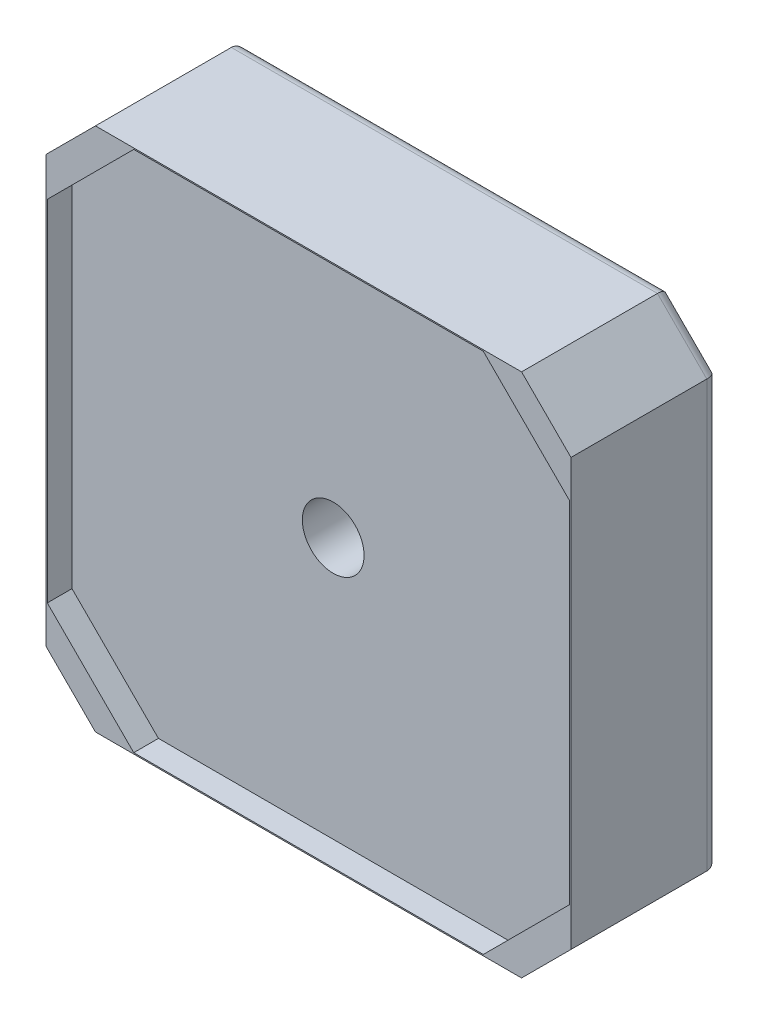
ISO-10303-21;
HEADER;
FILE_DESCRIPTION(('STEP AP214'),'2;1');
FILE_NAME('part.step','',(''),(''),'','','');
FILE_SCHEMA(('AUTOMOTIVE_DESIGN { 1 0 10303 214 1 1 1 1 }'));
ENDSEC;
DATA;
#1=APPLICATION_CONTEXT('core data for automotive mechanical design processes');
#2=APPLICATION_PROTOCOL_DEFINITION('international standard','automotive_design',2000,#1);
#3=PRODUCT_CONTEXT('',#1,'mechanical');
#4=PRODUCT('Part','Part','',(#3));
#5=PRODUCT_RELATED_PRODUCT_CATEGORY('part','',(#4));
#6=PRODUCT_DEFINITION_FORMATION('','',#4);
#7=PRODUCT_DEFINITION_CONTEXT('part definition',#1,'design');
#8=PRODUCT_DEFINITION('design','',#6,#7);
#9=PRODUCT_DEFINITION_SHAPE('','',#8);
#10=(LENGTH_UNIT() NAMED_UNIT(*) SI_UNIT(.MILLI.,.METRE.));
#11=(NAMED_UNIT(*) PLANE_ANGLE_UNIT() SI_UNIT($,.RADIAN.));
#12=(NAMED_UNIT(*) SI_UNIT($,.STERADIAN.) SOLID_ANGLE_UNIT());
#13=UNCERTAINTY_MEASURE_WITH_UNIT(LENGTH_MEASURE(1.E-05),#10,'distance_accuracy_value','');
#14=(GEOMETRIC_REPRESENTATION_CONTEXT(3) GLOBAL_UNCERTAINTY_ASSIGNED_CONTEXT((#13)) GLOBAL_UNIT_ASSIGNED_CONTEXT((#10,
#11,#12)) REPRESENTATION_CONTEXT('',''));
#15=CARTESIAN_POINT('',(0.,0.,0.));
#16=DIRECTION('',(0.,0.,1.));
#17=DIRECTION('',(1.,0.,0.));
#18=AXIS2_PLACEMENT_3D('',#15,#16,#17);
#19=CARTESIAN_POINT('',(-21.25,-17.25,12.));
#20=DIRECTION('',(1.,0.,0.));
#21=DIRECTION('',(0.,0.,-1.));
#22=AXIS2_PLACEMENT_3D('',#19,#20,#21);
#23=PLANE('',#22);
#24=DIRECTION('',(0.,0.,-1.));
#25=VECTOR('',#24,1.);
#26=CARTESIAN_POINT('',(-21.25,17.25,12.));
#27=LINE('',#26,#25);
#28=CARTESIAN_POINT('',(-21.25,17.25,12.));
#29=VERTEX_POINT('',#28);
#30=CARTESIAN_POINT('',(-21.25,17.25,1.));
#31=VERTEX_POINT('',#30);
#32=EDGE_CURVE('E267',#29,#31,#27,.T.);
#33=ORIENTED_EDGE('',*,*,#32,.T.);
#34=DIRECTION('',(0.,-1.,0.));
#35=VECTOR('',#34,1.);
#36=CARTESIAN_POINT('',(-21.25,-17.25,1.));
#37=LINE('',#36,#35);
#38=CARTESIAN_POINT('',(-21.25,-17.25,1.));
#39=VERTEX_POINT('',#38);
#40=EDGE_CURVE('E312',#31,#39,#37,.T.);
#41=ORIENTED_EDGE('',*,*,#40,.T.);
#42=DIRECTION('',(0.,0.,-1.));
#43=VECTOR('',#42,1.);
#44=CARTESIAN_POINT('',(-21.25,-17.25,12.));
#45=LINE('',#44,#43);
#46=CARTESIAN_POINT('',(-21.25,-17.25,12.));
#47=VERTEX_POINT('',#46);
#48=EDGE_CURVE('E285',#47,#39,#45,.T.);
#49=ORIENTED_EDGE('',*,*,#48,.F.);
#50=DIRECTION('',(0.,-1.,0.));
#51=VECTOR('',#50,1.);
#52=CARTESIAN_POINT('',(-21.25,-17.25,12.));
#53=LINE('',#52,#51);
#54=EDGE_CURVE('E239',#29,#47,#53,.T.);
#55=ORIENTED_EDGE('',*,*,#54,.F.);
#56=EDGE_LOOP('',(#33,#41,#49,#55));
#57=FACE_BOUND('',#56,.T.);
#58=ADVANCED_FACE('F33',(#57),#23,.F.);
#59=CARTESIAN_POINT('',(-21.25,-17.25,12.));
#60=DIRECTION('',(0.707106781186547,0.707106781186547,0.));
#61=DIRECTION('',(-0.707106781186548,0.707106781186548,0.));
#62=AXIS2_PLACEMENT_3D('',#59,#60,#61);
#63=PLANE('',#62);
#64=ORIENTED_EDGE('',*,*,#48,.T.);
#65=DIRECTION('',(0.707106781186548,-0.707106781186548,0.));
#66=VECTOR('',#65,1.);
#67=CARTESIAN_POINT('',(-17.25,-21.25,1.));
#68=LINE('',#67,#66);
#69=CARTESIAN_POINT('',(-17.25,-21.25,1.));
#70=VERTEX_POINT('',#69);
#71=EDGE_CURVE('E310',#39,#70,#68,.T.);
#72=ORIENTED_EDGE('',*,*,#71,.T.);
#73=DIRECTION('',(0.,0.,-1.));
#74=VECTOR('',#73,1.);
#75=CARTESIAN_POINT('',(-17.25,-21.25,12.));
#76=LINE('',#75,#74);
#77=CARTESIAN_POINT('',(-17.25,-21.25,12.));
#78=VERTEX_POINT('',#77);
#79=EDGE_CURVE('E282',#78,#70,#76,.T.);
#80=ORIENTED_EDGE('',*,*,#79,.F.);
#81=DIRECTION('',(0.707106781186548,-0.707106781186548,0.));
#82=VECTOR('',#81,1.);
#83=CARTESIAN_POINT('',(-21.25,-17.25,12.));
#84=LINE('',#83,#82);
#85=EDGE_CURVE('E253',#47,#78,#84,.T.);
#86=ORIENTED_EDGE('',*,*,#85,.F.);
#87=EDGE_LOOP('',(#64,#72,#80,#86));
#88=FACE_BOUND('',#87,.T.);
#89=ADVANCED_FACE('F399',(#88),#63,.F.);
#90=CARTESIAN_POINT('',(-17.25,-21.25,12.));
#91=DIRECTION('',(0.,1.,0.));
#92=DIRECTION('',(0.,0.,1.));
#93=AXIS2_PLACEMENT_3D('',#90,#91,#92);
#94=PLANE('',#93);
#95=ORIENTED_EDGE('',*,*,#79,.T.);
#96=DIRECTION('',(1.,0.,0.));
#97=VECTOR('',#96,1.);
#98=CARTESIAN_POINT('',(17.25,-21.25,1.));
#99=LINE('',#98,#97);
#100=CARTESIAN_POINT('',(17.25,-21.25,1.));
#101=VERTEX_POINT('',#100);
#102=EDGE_CURVE('E308',#70,#101,#99,.T.);
#103=ORIENTED_EDGE('',*,*,#102,.T.);
#104=DIRECTION('',(0.,0.,-1.));
#105=VECTOR('',#104,1.);
#106=CARTESIAN_POINT('',(17.25,-21.25,12.));
#107=LINE('',#106,#105);
#108=CARTESIAN_POINT('',(17.25,-21.25,12.));
#109=VERTEX_POINT('',#108);
#110=EDGE_CURVE('E279',#109,#101,#107,.T.);
#111=ORIENTED_EDGE('',*,*,#110,.F.);
#112=DIRECTION('',(1.,0.,0.));
#113=VECTOR('',#112,1.);
#114=CARTESIAN_POINT('',(-17.25,-21.25,12.));
#115=LINE('',#114,#113);
#116=EDGE_CURVE('E255',#78,#109,#115,.T.);
#117=ORIENTED_EDGE('',*,*,#116,.F.);
#118=EDGE_LOOP('',(#95,#103,#111,#117));
#119=FACE_BOUND('',#118,.T.);
#120=ADVANCED_FACE('F405',(#119),#94,.F.);
#121=CARTESIAN_POINT('',(17.25,-21.25,12.));
#122=DIRECTION('',(-0.707106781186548,0.707106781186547,0.));
#123=DIRECTION('',(-0.707106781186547,-0.707106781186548,0.));
#124=AXIS2_PLACEMENT_3D('',#121,#122,#123);
#125=PLANE('',#124);
#126=ORIENTED_EDGE('',*,*,#110,.T.);
#127=DIRECTION('',(0.707106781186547,0.707106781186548,0.));
#128=VECTOR('',#127,1.);
#129=CARTESIAN_POINT('',(21.25,-17.25,1.));
#130=LINE('',#129,#128);
#131=CARTESIAN_POINT('',(21.25,-17.25,1.));
#132=VERTEX_POINT('',#131);
#133=EDGE_CURVE('E288',#101,#132,#130,.T.);
#134=ORIENTED_EDGE('',*,*,#133,.T.);
#135=DIRECTION('',(0.,0.,-1.));
#136=VECTOR('',#135,1.);
#137=CARTESIAN_POINT('',(21.25,-17.25,12.));
#138=LINE('',#137,#136);
#139=CARTESIAN_POINT('',(21.25,-17.25,12.));
#140=VERTEX_POINT('',#139);
#141=EDGE_CURVE('E277',#140,#132,#138,.T.);
#142=ORIENTED_EDGE('',*,*,#141,.F.);
#143=DIRECTION('',(0.707106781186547,0.707106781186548,0.));
#144=VECTOR('',#143,1.);
#145=CARTESIAN_POINT('',(17.25,-21.25,12.));
#146=LINE('',#145,#144);
#147=EDGE_CURVE('E257',#109,#140,#146,.T.);
#148=ORIENTED_EDGE('',*,*,#147,.F.);
#149=EDGE_LOOP('',(#126,#134,#142,#148));
#150=FACE_BOUND('',#149,.T.);
#151=ADVANCED_FACE('F526',(#150),#125,.F.);
#152=CARTESIAN_POINT('',(21.25,-17.25,12.));
#153=DIRECTION('',(-1.,0.,0.));
#154=DIRECTION('',(0.,-1.,0.));
#155=AXIS2_PLACEMENT_3D('',#152,#153,#154);
#156=PLANE('',#155);
#157=ORIENTED_EDGE('',*,*,#141,.T.);
#158=DIRECTION('',(0.,1.,0.));
#159=VECTOR('',#158,1.);
#160=CARTESIAN_POINT('',(21.25,17.25,1.));
#161=LINE('',#160,#159);
#162=CARTESIAN_POINT('',(21.25,17.25,1.));
#163=VERTEX_POINT('',#162);
#164=EDGE_CURVE('E56',#132,#163,#161,.T.);
#165=ORIENTED_EDGE('',*,*,#164,.T.);
#166=DIRECTION('',(0.,0.,-1.));
#167=VECTOR('',#166,1.);
#168=CARTESIAN_POINT('',(21.25,17.25,12.));
#169=LINE('',#168,#167);
#170=CARTESIAN_POINT('',(21.25,17.25,12.));
#171=VERTEX_POINT('',#170);
#172=EDGE_CURVE('E275',#171,#163,#169,.T.);
#173=ORIENTED_EDGE('',*,*,#172,.F.);
#174=DIRECTION('',(0.,1.,0.));
#175=VECTOR('',#174,1.);
#176=CARTESIAN_POINT('',(21.25,-17.25,12.));
#177=LINE('',#176,#175);
#178=EDGE_CURVE('E259',#140,#171,#177,.T.);
#179=ORIENTED_EDGE('',*,*,#178,.F.);
#180=EDGE_LOOP('',(#157,#165,#173,#179));
#181=FACE_BOUND('',#180,.T.);
#182=ADVANCED_FACE('F523',(#181),#156,.F.);
#183=CARTESIAN_POINT('',(17.25,21.25,12.));
#184=DIRECTION('',(-0.707106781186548,-0.707106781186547,0.));
#185=DIRECTION('',(0.707106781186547,-0.707106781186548,0.));
#186=AXIS2_PLACEMENT_3D('',#183,#184,#185);
#187=PLANE('',#186);
#188=ORIENTED_EDGE('',*,*,#172,.T.);
#189=DIRECTION('',(-0.707106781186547,0.707106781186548,0.));
#190=VECTOR('',#189,1.);
#191=CARTESIAN_POINT('',(17.25,21.25,1.));
#192=LINE('',#191,#190);
#193=CARTESIAN_POINT('',(17.25,21.25,1.));
#194=VERTEX_POINT('',#193);
#195=EDGE_CURVE('E48',#163,#194,#192,.T.);
#196=ORIENTED_EDGE('',*,*,#195,.T.);
#197=DIRECTION('',(0.,0.,-1.));
#198=VECTOR('',#197,1.);
#199=CARTESIAN_POINT('',(17.25,21.25,12.));
#200=LINE('',#199,#198);
#201=CARTESIAN_POINT('',(17.25,21.25,12.));
#202=VERTEX_POINT('',#201);
#203=EDGE_CURVE('E273',#202,#194,#200,.T.);
#204=ORIENTED_EDGE('',*,*,#203,.F.);
#205=DIRECTION('',(-0.707106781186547,0.707106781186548,0.));
#206=VECTOR('',#205,1.);
#207=CARTESIAN_POINT('',(17.25,21.25,12.));
#208=LINE('',#207,#206);
#209=EDGE_CURVE('E261',#171,#202,#208,.T.);
#210=ORIENTED_EDGE('',*,*,#209,.F.);
#211=EDGE_LOOP('',(#188,#196,#204,#210));
#212=FACE_BOUND('',#211,.T.);
#213=ADVANCED_FACE('F519',(#212),#187,.F.);
#214=CARTESIAN_POINT('',(-17.25,21.25,12.));
#215=DIRECTION('',(0.,-1.,0.));
#216=DIRECTION('',(0.,0.,-1.));
#217=AXIS2_PLACEMENT_3D('',#214,#215,#216);
#218=PLANE('',#217);
#219=ORIENTED_EDGE('',*,*,#203,.T.);
#220=DIRECTION('',(-1.,0.,0.));
#221=VECTOR('',#220,1.);
#222=CARTESIAN_POINT('',(-17.25,21.25,1.));
#223=LINE('',#222,#221);
#224=CARTESIAN_POINT('',(-17.25,21.25,1.));
#225=VERTEX_POINT('',#224);
#226=EDGE_CURVE('E318',#194,#225,#223,.T.);
#227=ORIENTED_EDGE('',*,*,#226,.T.);
#228=DIRECTION('',(0.,0.,-1.));
#229=VECTOR('',#228,1.);
#230=CARTESIAN_POINT('',(-17.25,21.25,12.));
#231=LINE('',#230,#229);
#232=CARTESIAN_POINT('',(-17.25,21.25,12.));
#233=VERTEX_POINT('',#232);
#234=EDGE_CURVE('E270',#233,#225,#231,.T.);
#235=ORIENTED_EDGE('',*,*,#234,.F.);
#236=DIRECTION('',(-1.,0.,0.));
#237=VECTOR('',#236,1.);
#238=CARTESIAN_POINT('',(-17.25,21.25,12.));
#239=LINE('',#238,#237);
#240=EDGE_CURVE('E263',#202,#233,#239,.T.);
#241=ORIENTED_EDGE('',*,*,#240,.F.);
#242=EDGE_LOOP('',(#219,#227,#235,#241));
#243=FACE_BOUND('',#242,.T.);
#244=ADVANCED_FACE('F515',(#243),#218,.F.);
#245=CARTESIAN_POINT('',(-21.25,17.25,12.));
#246=DIRECTION('',(0.707106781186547,-0.707106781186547,0.));
#247=DIRECTION('',(0.707106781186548,0.707106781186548,0.));
#248=AXIS2_PLACEMENT_3D('',#245,#246,#247);
#249=PLANE('',#248);
#250=ORIENTED_EDGE('',*,*,#234,.T.);
#251=DIRECTION('',(-0.707106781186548,-0.707106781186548,0.));
#252=VECTOR('',#251,1.);
#253=CARTESIAN_POINT('',(-21.25,17.25,1.));
#254=LINE('',#253,#252);
#255=EDGE_CURVE('E314',#225,#31,#254,.T.);
#256=ORIENTED_EDGE('',*,*,#255,.T.);
#257=ORIENTED_EDGE('',*,*,#32,.F.);
#258=DIRECTION('',(-0.707106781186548,-0.707106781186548,0.));
#259=VECTOR('',#258,1.);
#260=CARTESIAN_POINT('',(-21.25,17.25,12.));
#261=LINE('',#260,#259);
#262=EDGE_CURVE('E265',#233,#29,#261,.T.);
#263=ORIENTED_EDGE('',*,*,#262,.F.);
#264=EDGE_LOOP('',(#250,#256,#257,#263));
#265=FACE_BOUND('',#264,.T.);
#266=ADVANCED_FACE('F508',(#265),#249,.F.);
#267=CARTESIAN_POINT('',(0.,0.,12.));
#268=DIRECTION('',(0.,0.,-1.));
#269=DIRECTION('',(-1.,0.,0.));
#270=AXIS2_PLACEMENT_3D('',#267,#268,#269);
#271=PLANE('',#270);
#272=DIRECTION('',(0.707106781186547,-0.707106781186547,0.));
#273=VECTOR('',#272,1.);
#274=CARTESIAN_POINT('',(-21.15,-14.15,12.));
#275=LINE('',#274,#273);
#276=CARTESIAN_POINT('',(-21.15,-14.15,12.));
#277=VERTEX_POINT('',#276);
#278=CARTESIAN_POINT('',(-14.15,-21.15,12.));
#279=VERTEX_POINT('',#278);
#280=EDGE_CURVE('E221',#277,#279,#275,.T.);
#281=ORIENTED_EDGE('',*,*,#280,.F.);
#282=DIRECTION('',(0.,-1.,0.));
#283=VECTOR('',#282,1.);
#284=CARTESIAN_POINT('',(-21.15,-14.15,12.));
#285=LINE('',#284,#283);
#286=CARTESIAN_POINT('',(-21.15,14.15,12.));
#287=VERTEX_POINT('',#286);
#288=EDGE_CURVE('E180',#287,#277,#285,.T.);
#289=ORIENTED_EDGE('',*,*,#288,.F.);
#290=DIRECTION('',(-0.707106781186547,-0.707106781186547,0.));
#291=VECTOR('',#290,1.);
#292=CARTESIAN_POINT('',(-21.15,14.15,12.));
#293=LINE('',#292,#291);
#294=CARTESIAN_POINT('',(-14.15,21.15,12.));
#295=VERTEX_POINT('',#294);
#296=EDGE_CURVE('E198',#295,#287,#293,.T.);
#297=ORIENTED_EDGE('',*,*,#296,.F.);
#298=DIRECTION('',(-1.,0.,0.));
#299=VECTOR('',#298,1.);
#300=CARTESIAN_POINT('',(-14.15,21.15,12.));
#301=LINE('',#300,#299);
#302=CARTESIAN_POINT('',(14.15,21.15,12.));
#303=VERTEX_POINT('',#302);
#304=EDGE_CURVE('E201',#303,#295,#301,.T.);
#305=ORIENTED_EDGE('',*,*,#304,.F.);
#306=DIRECTION('',(-0.707106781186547,0.707106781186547,0.));
#307=VECTOR('',#306,1.);
#308=CARTESIAN_POINT('',(14.15,21.15,12.));
#309=LINE('',#308,#307);
#310=CARTESIAN_POINT('',(21.15,14.15,12.));
#311=VERTEX_POINT('',#310);
#312=EDGE_CURVE('E232',#311,#303,#309,.T.);
#313=ORIENTED_EDGE('',*,*,#312,.F.);
#314=DIRECTION('',(0.,1.,0.));
#315=VECTOR('',#314,1.);
#316=CARTESIAN_POINT('',(21.15,-14.15,12.));
#317=LINE('',#316,#315);
#318=CARTESIAN_POINT('',(21.15,-14.15,12.));
#319=VERTEX_POINT('',#318);
#320=EDGE_CURVE('E229',#319,#311,#317,.T.);
#321=ORIENTED_EDGE('',*,*,#320,.F.);
#322=DIRECTION('',(0.707106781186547,0.707106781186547,0.));
#323=VECTOR('',#322,1.);
#324=CARTESIAN_POINT('',(14.15,-21.15,12.));
#325=LINE('',#324,#323);
#326=CARTESIAN_POINT('',(14.15,-21.15,12.));
#327=VERTEX_POINT('',#326);
#328=EDGE_CURVE('E226',#327,#319,#325,.T.);
#329=ORIENTED_EDGE('',*,*,#328,.F.);
#330=DIRECTION('',(1.,0.,0.));
#331=VECTOR('',#330,1.);
#332=CARTESIAN_POINT('',(-14.15,-21.15,12.));
#333=LINE('',#332,#331);
#334=EDGE_CURVE('E223',#279,#327,#333,.T.);
#335=ORIENTED_EDGE('',*,*,#334,.F.);
#336=EDGE_LOOP('',(#281,#289,#297,#305,#313,#321,#329,#335));
#337=FACE_BOUND('',#336,.T.);
#338=ORIENTED_EDGE('',*,*,#54,.T.);
#339=ORIENTED_EDGE('',*,*,#85,.T.);
#340=ORIENTED_EDGE('',*,*,#116,.T.);
#341=ORIENTED_EDGE('',*,*,#147,.T.);
#342=ORIENTED_EDGE('',*,*,#178,.T.);
#343=ORIENTED_EDGE('',*,*,#209,.T.);
#344=ORIENTED_EDGE('',*,*,#240,.T.);
#345=ORIENTED_EDGE('',*,*,#262,.T.);
#346=EDGE_LOOP('',(#338,#339,#340,#341,#342,#343,#344,#345));
#347=FACE_BOUND('',#346,.T.);
#348=ADVANCED_FACE('F499',(#337,#347),#271,.F.);
#349=CARTESIAN_POINT('',(0.,0.,0.));
#350=DIRECTION('',(0.,0.,-1.));
#351=DIRECTION('',(-1.,0.,0.));
#352=AXIS2_PLACEMENT_3D('',#349,#350,#351);
#353=PLANE('',#352);
#354=CARTESIAN_POINT('',(15.5,-15.5,0.));
#355=DIRECTION('',(0.,0.,-1.));
#356=DIRECTION('',(-1.,0.,0.));
#357=AXIS2_PLACEMENT_3D('',#354,#355,#356);
#358=CIRCLE('',#357,1.5);
#359=CARTESIAN_POINT('',(14.,-15.5,0.));
#360=VERTEX_POINT('',#359);
#361=EDGE_CURVE('E374',#360,#360,#358,.F.);
#362=ORIENTED_EDGE('',*,*,#361,.T.);
#363=EDGE_LOOP('',(#362));
#364=FACE_BOUND('',#363,.T.);
#365=CARTESIAN_POINT('',(-15.5,-15.5,0.));
#366=DIRECTION('',(0.,0.,-1.));
#367=DIRECTION('',(-1.,0.,0.));
#368=AXIS2_PLACEMENT_3D('',#365,#366,#367);
#369=CIRCLE('',#368,1.5);
#370=CARTESIAN_POINT('',(-17.,-15.5,0.));
#371=VERTEX_POINT('',#370);
#372=EDGE_CURVE('E371',#371,#371,#369,.F.);
#373=ORIENTED_EDGE('',*,*,#372,.T.);
#374=EDGE_LOOP('',(#373));
#375=FACE_BOUND('',#374,.T.);
#376=CARTESIAN_POINT('',(-15.5,15.5,0.));
#377=DIRECTION('',(0.,0.,-1.));
#378=DIRECTION('',(-1.,0.,0.));
#379=AXIS2_PLACEMENT_3D('',#376,#377,#378);
#380=CIRCLE('',#379,1.5);
#381=CARTESIAN_POINT('',(-17.,15.5,0.));
#382=VERTEX_POINT('',#381);
#383=EDGE_CURVE('E368',#382,#382,#380,.F.);
#384=ORIENTED_EDGE('',*,*,#383,.T.);
#385=EDGE_LOOP('',(#384));
#386=FACE_BOUND('',#385,.T.);
#387=CARTESIAN_POINT('',(15.5,15.5,0.));
#388=DIRECTION('',(0.,0.,-1.));
#389=DIRECTION('',(-1.,0.,0.));
#390=AXIS2_PLACEMENT_3D('',#387,#388,#389);
#391=CIRCLE('',#390,1.5);
#392=CARTESIAN_POINT('',(14.,15.5,0.));
#393=VERTEX_POINT('',#392);
#394=EDGE_CURVE('E365',#393,#393,#391,.F.);
#395=ORIENTED_EDGE('',*,*,#394,.T.);
#396=EDGE_LOOP('',(#395));
#397=FACE_BOUND('',#396,.T.);
#398=DIRECTION('',(0.,1.,0.));
#399=VECTOR('',#398,1.);
#400=CARTESIAN_POINT('',(20.25,-17.25,0.));
#401=LINE('',#400,#399);
#402=CARTESIAN_POINT('',(20.25,16.8357864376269,0.));
#403=VERTEX_POINT('',#402);
#404=CARTESIAN_POINT('',(20.25,-16.8357864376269,0.));
#405=VERTEX_POINT('',#404);
#406=EDGE_CURVE('E295',#403,#405,#401,.F.);
#407=ORIENTED_EDGE('',*,*,#406,.T.);
#408=DIRECTION('',(0.707106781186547,0.707106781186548,0.));
#409=VECTOR('',#408,1.);
#410=CARTESIAN_POINT('',(16.5428932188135,-20.5428932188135,0.));
#411=LINE('',#410,#409);
#412=CARTESIAN_POINT('',(16.8357864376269,-20.25,0.));
#413=VERTEX_POINT('',#412);
#414=EDGE_CURVE('E305',#405,#413,#411,.F.);
#415=ORIENTED_EDGE('',*,*,#414,.T.);
#416=DIRECTION('',(1.,0.,0.));
#417=VECTOR('',#416,1.);
#418=CARTESIAN_POINT('',(-17.25,-20.25,0.));
#419=LINE('',#418,#417);
#420=CARTESIAN_POINT('',(-16.8357864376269,-20.25,0.));
#421=VERTEX_POINT('',#420);
#422=EDGE_CURVE('E303',#413,#421,#419,.F.);
#423=ORIENTED_EDGE('',*,*,#422,.T.);
#424=DIRECTION('',(0.707106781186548,-0.707106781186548,0.));
#425=VECTOR('',#424,1.);
#426=CARTESIAN_POINT('',(-20.5428932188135,-16.5428932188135,0.));
#427=LINE('',#426,#425);
#428=CARTESIAN_POINT('',(-20.25,-16.8357864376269,0.));
#429=VERTEX_POINT('',#428);
#430=EDGE_CURVE('E301',#421,#429,#427,.F.);
#431=ORIENTED_EDGE('',*,*,#430,.T.);
#432=DIRECTION('',(0.,-1.,0.));
#433=VECTOR('',#432,1.);
#434=CARTESIAN_POINT('',(-20.25,17.25,0.));
#435=LINE('',#434,#433);
#436=CARTESIAN_POINT('',(-20.25,16.8357864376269,0.));
#437=VERTEX_POINT('',#436);
#438=EDGE_CURVE('E299',#429,#437,#435,.F.);
#439=ORIENTED_EDGE('',*,*,#438,.T.);
#440=DIRECTION('',(-0.707106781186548,-0.707106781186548,0.));
#441=VECTOR('',#440,1.);
#442=CARTESIAN_POINT('',(-16.5428932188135,20.5428932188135,0.));
#443=LINE('',#442,#441);
#444=CARTESIAN_POINT('',(-16.8357864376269,20.25,0.));
#445=VERTEX_POINT('',#444);
#446=EDGE_CURVE('E297',#437,#445,#443,.F.);
#447=ORIENTED_EDGE('',*,*,#446,.T.);
#448=DIRECTION('',(-1.,0.,0.));
#449=VECTOR('',#448,1.);
#450=CARTESIAN_POINT('',(17.25,20.25,0.));
#451=LINE('',#450,#449);
#452=CARTESIAN_POINT('',(16.8357864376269,20.25,0.));
#453=VERTEX_POINT('',#452);
#454=EDGE_CURVE('E291',#445,#453,#451,.F.);
#455=ORIENTED_EDGE('',*,*,#454,.T.);
#456=DIRECTION('',(-0.707106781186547,0.707106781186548,0.));
#457=VECTOR('',#456,1.);
#458=CARTESIAN_POINT('',(20.5428932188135,16.5428932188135,0.));
#459=LINE('',#458,#457);
#460=EDGE_CURVE('E293',#453,#403,#459,.F.);
#461=ORIENTED_EDGE('',*,*,#460,.T.);
#462=EDGE_LOOP('',(#407,#415,#423,#431,#439,#447,#455,#461));
#463=FACE_BOUND('',#462,.T.);
#464=CARTESIAN_POINT('',(0.,0.,0.));
#465=DIRECTION('',(0.,0.,-1.));
#466=DIRECTION('',(-1.,0.,0.));
#467=AXIS2_PLACEMENT_3D('',#464,#465,#466);
#468=CIRCLE('',#467,11.);
#469=CARTESIAN_POINT('',(-11.,0.,0.));
#470=VERTEX_POINT('',#469);
#471=EDGE_CURVE('E204',#470,#470,#468,.T.);
#472=ORIENTED_EDGE('',*,*,#471,.F.);
#473=EDGE_LOOP('',(#472));
#474=FACE_BOUND('',#473,.T.);
#475=ADVANCED_FACE('F497',(#364,#375,#386,#397,#463,#474),#353,.T.);
#476=CARTESIAN_POINT('',(-21.15,-14.15,10.));
#477=DIRECTION('',(-1.,0.,0.));
#478=DIRECTION('',(0.,0.,1.));
#479=AXIS2_PLACEMENT_3D('',#476,#477,#478);
#480=PLANE('',#479);
#481=ORIENTED_EDGE('',*,*,#288,.T.);
#482=DIRECTION('',(0.,0.,1.));
#483=VECTOR('',#482,1.);
#484=CARTESIAN_POINT('',(-21.15,-14.15,10.));
#485=LINE('',#484,#483);
#486=CARTESIAN_POINT('',(-21.15,-14.15,10.));
#487=VERTEX_POINT('',#486);
#488=EDGE_CURVE('E173',#487,#277,#485,.T.);
#489=ORIENTED_EDGE('',*,*,#488,.F.);
#490=DIRECTION('',(0.,-1.,0.));
#491=VECTOR('',#490,1.);
#492=CARTESIAN_POINT('',(-21.15,-14.15,10.));
#493=LINE('',#492,#491);
#494=CARTESIAN_POINT('',(-21.15,14.15,10.));
#495=VERTEX_POINT('',#494);
#496=EDGE_CURVE('E177',#495,#487,#493,.T.);
#497=ORIENTED_EDGE('',*,*,#496,.F.);
#498=DIRECTION('',(0.,0.,1.));
#499=VECTOR('',#498,1.);
#500=CARTESIAN_POINT('',(-21.15,14.15,10.));
#501=LINE('',#500,#499);
#502=EDGE_CURVE('E237',#495,#287,#501,.T.);
#503=ORIENTED_EDGE('',*,*,#502,.T.);
#504=EDGE_LOOP('',(#481,#489,#497,#503));
#505=FACE_BOUND('',#504,.T.);
#506=ADVANCED_FACE('F175',(#505),#480,.F.);
#507=CARTESIAN_POINT('',(-21.15,14.15,10.));
#508=DIRECTION('',(-0.707106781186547,0.707106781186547,0.));
#509=DIRECTION('',(-0.707106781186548,-0.707106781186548,0.));
#510=AXIS2_PLACEMENT_3D('',#507,#508,#509);
#511=PLANE('',#510);
#512=ORIENTED_EDGE('',*,*,#296,.T.);
#513=ORIENTED_EDGE('',*,*,#502,.F.);
#514=DIRECTION('',(-0.707106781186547,-0.707106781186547,0.));
#515=VECTOR('',#514,1.);
#516=CARTESIAN_POINT('',(-21.15,14.15,10.));
#517=LINE('',#516,#515);
#518=CARTESIAN_POINT('',(-14.15,21.15,10.));
#519=VERTEX_POINT('',#518);
#520=EDGE_CURVE('E185',#519,#495,#517,.T.);
#521=ORIENTED_EDGE('',*,*,#520,.F.);
#522=DIRECTION('',(0.,0.,1.));
#523=VECTOR('',#522,1.);
#524=CARTESIAN_POINT('',(-14.15,21.15,10.));
#525=LINE('',#524,#523);
#526=EDGE_CURVE('E240',#519,#295,#525,.T.);
#527=ORIENTED_EDGE('',*,*,#526,.T.);
#528=EDGE_LOOP('',(#512,#513,#521,#527));
#529=FACE_BOUND('',#528,.T.);
#530=ADVANCED_FACE('F506',(#529),#511,.F.);
#531=CARTESIAN_POINT('',(-14.15,21.15,10.));
#532=DIRECTION('',(0.,1.,0.));
#533=DIRECTION('',(0.,0.,1.));
#534=AXIS2_PLACEMENT_3D('',#531,#532,#533);
#535=PLANE('',#534);
#536=ORIENTED_EDGE('',*,*,#304,.T.);
#537=ORIENTED_EDGE('',*,*,#526,.F.);
#538=DIRECTION('',(-1.,0.,0.));
#539=VECTOR('',#538,1.);
#540=CARTESIAN_POINT('',(-14.15,21.15,10.));
#541=LINE('',#540,#539);
#542=CARTESIAN_POINT('',(14.15,21.15,10.));
#543=VERTEX_POINT('',#542);
#544=EDGE_CURVE('E217',#543,#519,#541,.T.);
#545=ORIENTED_EDGE('',*,*,#544,.F.);
#546=DIRECTION('',(0.,0.,1.));
#547=VECTOR('',#546,1.);
#548=CARTESIAN_POINT('',(14.15,21.15,10.));
#549=LINE('',#548,#547);
#550=EDGE_CURVE('E242',#543,#303,#549,.T.);
#551=ORIENTED_EDGE('',*,*,#550,.T.);
#552=EDGE_LOOP('',(#536,#537,#545,#551));
#553=FACE_BOUND('',#552,.T.);
#554=ADVANCED_FACE('F613',(#553),#535,.F.);
#555=CARTESIAN_POINT('',(14.15,21.15,10.));
#556=DIRECTION('',(0.707106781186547,0.707106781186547,0.));
#557=DIRECTION('',(-0.707106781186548,0.707106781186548,0.));
#558=AXIS2_PLACEMENT_3D('',#555,#556,#557);
#559=PLANE('',#558);
#560=ORIENTED_EDGE('',*,*,#312,.T.);
#561=ORIENTED_EDGE('',*,*,#550,.F.);
#562=DIRECTION('',(-0.707106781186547,0.707106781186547,0.));
#563=VECTOR('',#562,1.);
#564=CARTESIAN_POINT('',(14.15,21.15,10.));
#565=LINE('',#564,#563);
#566=CARTESIAN_POINT('',(21.15,14.15,10.));
#567=VERTEX_POINT('',#566);
#568=EDGE_CURVE('E214',#567,#543,#565,.T.);
#569=ORIENTED_EDGE('',*,*,#568,.F.);
#570=DIRECTION('',(0.,0.,1.));
#571=VECTOR('',#570,1.);
#572=CARTESIAN_POINT('',(21.15,14.15,10.));
#573=LINE('',#572,#571);
#574=EDGE_CURVE('E244',#567,#311,#573,.T.);
#575=ORIENTED_EDGE('',*,*,#574,.T.);
#576=EDGE_LOOP('',(#560,#561,#569,#575));
#577=FACE_BOUND('',#576,.T.);
#578=ADVANCED_FACE('F623',(#577),#559,.F.);
#579=CARTESIAN_POINT('',(21.15,-14.15,10.));
#580=DIRECTION('',(1.,0.,0.));
#581=DIRECTION('',(0.,0.,-1.));
#582=AXIS2_PLACEMENT_3D('',#579,#580,#581);
#583=PLANE('',#582);
#584=ORIENTED_EDGE('',*,*,#320,.T.);
#585=ORIENTED_EDGE('',*,*,#574,.F.);
#586=DIRECTION('',(0.,1.,0.));
#587=VECTOR('',#586,1.);
#588=CARTESIAN_POINT('',(21.15,-14.15,10.));
#589=LINE('',#588,#587);
#590=CARTESIAN_POINT('',(21.15,-14.15,10.));
#591=VERTEX_POINT('',#590);
#592=EDGE_CURVE('E211',#591,#567,#589,.T.);
#593=ORIENTED_EDGE('',*,*,#592,.F.);
#594=DIRECTION('',(0.,0.,1.));
#595=VECTOR('',#594,1.);
#596=CARTESIAN_POINT('',(21.15,-14.15,10.));
#597=LINE('',#596,#595);
#598=EDGE_CURVE('E246',#591,#319,#597,.T.);
#599=ORIENTED_EDGE('',*,*,#598,.T.);
#600=EDGE_LOOP('',(#584,#585,#593,#599));
#601=FACE_BOUND('',#600,.T.);
#602=ADVANCED_FACE('F633',(#601),#583,.F.);
#603=CARTESIAN_POINT('',(14.15,-21.15,10.));
#604=DIRECTION('',(0.707106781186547,-0.707106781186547,0.));
#605=DIRECTION('',(0.707106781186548,0.707106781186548,0.));
#606=AXIS2_PLACEMENT_3D('',#603,#604,#605);
#607=PLANE('',#606);
#608=ORIENTED_EDGE('',*,*,#328,.T.);
#609=ORIENTED_EDGE('',*,*,#598,.F.);
#610=DIRECTION('',(0.707106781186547,0.707106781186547,0.));
#611=VECTOR('',#610,1.);
#612=CARTESIAN_POINT('',(14.15,-21.15,10.));
#613=LINE('',#612,#611);
#614=CARTESIAN_POINT('',(14.15,-21.15,10.));
#615=VERTEX_POINT('',#614);
#616=EDGE_CURVE('E208',#615,#591,#613,.T.);
#617=ORIENTED_EDGE('',*,*,#616,.F.);
#618=DIRECTION('',(0.,0.,1.));
#619=VECTOR('',#618,1.);
#620=CARTESIAN_POINT('',(14.15,-21.15,10.));
#621=LINE('',#620,#619);
#622=EDGE_CURVE('E248',#615,#327,#621,.T.);
#623=ORIENTED_EDGE('',*,*,#622,.T.);
#624=EDGE_LOOP('',(#608,#609,#617,#623));
#625=FACE_BOUND('',#624,.T.);
#626=ADVANCED_FACE('F643',(#625),#607,.F.);
#627=CARTESIAN_POINT('',(-14.15,-21.15,10.));
#628=DIRECTION('',(0.,-1.,0.));
#629=DIRECTION('',(0.,0.,-1.));
#630=AXIS2_PLACEMENT_3D('',#627,#628,#629);
#631=PLANE('',#630);
#632=ORIENTED_EDGE('',*,*,#334,.T.);
#633=ORIENTED_EDGE('',*,*,#622,.F.);
#634=DIRECTION('',(1.,0.,0.));
#635=VECTOR('',#634,1.);
#636=CARTESIAN_POINT('',(-14.15,-21.15,10.));
#637=LINE('',#636,#635);
#638=CARTESIAN_POINT('',(-14.15,-21.15,10.));
#639=VERTEX_POINT('',#638);
#640=EDGE_CURVE('E193',#639,#615,#637,.T.);
#641=ORIENTED_EDGE('',*,*,#640,.F.);
#642=DIRECTION('',(0.,0.,1.));
#643=VECTOR('',#642,1.);
#644=CARTESIAN_POINT('',(-14.15,-21.15,10.));
#645=LINE('',#644,#643);
#646=EDGE_CURVE('E184',#639,#279,#645,.T.);
#647=ORIENTED_EDGE('',*,*,#646,.T.);
#648=EDGE_LOOP('',(#632,#633,#641,#647));
#649=FACE_BOUND('',#648,.T.);
#650=ADVANCED_FACE('F653',(#649),#631,.F.);
#651=CARTESIAN_POINT('',(-21.15,-14.15,10.));
#652=DIRECTION('',(-0.707106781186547,-0.707106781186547,0.));
#653=DIRECTION('',(0.707106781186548,-0.707106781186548,0.));
#654=AXIS2_PLACEMENT_3D('',#651,#652,#653);
#655=PLANE('',#654);
#656=ORIENTED_EDGE('',*,*,#280,.T.);
#657=ORIENTED_EDGE('',*,*,#646,.F.);
#658=DIRECTION('',(0.707106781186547,-0.707106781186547,0.));
#659=VECTOR('',#658,1.);
#660=CARTESIAN_POINT('',(-21.15,-14.15,10.));
#661=LINE('',#660,#659);
#662=EDGE_CURVE('E188',#487,#639,#661,.T.);
#663=ORIENTED_EDGE('',*,*,#662,.F.);
#664=ORIENTED_EDGE('',*,*,#488,.T.);
#665=EDGE_LOOP('',(#656,#657,#663,#664));
#666=FACE_BOUND('',#665,.T.);
#667=ADVANCED_FACE('F189',(#666),#655,.F.);
#668=CARTESIAN_POINT('',(0.,0.,10.));
#669=DIRECTION('',(0.,0.,-1.));
#670=DIRECTION('',(-1.,0.,0.));
#671=AXIS2_PLACEMENT_3D('',#668,#669,#670);
#672=PLANE('',#671);
#673=CARTESIAN_POINT('',(0.,0.,10.));
#674=DIRECTION('',(0.,0.,-1.));
#675=DIRECTION('',(-1.,0.,0.));
#676=AXIS2_PLACEMENT_3D('',#673,#674,#675);
#677=CIRCLE('',#676,2.5);
#678=CARTESIAN_POINT('',(-2.5,0.,10.));
#679=VERTEX_POINT('',#678);
#680=EDGE_CURVE('E488',#679,#679,#677,.T.);
#681=ORIENTED_EDGE('',*,*,#680,.T.);
#682=EDGE_LOOP('',(#681));
#683=FACE_BOUND('',#682,.T.);
#684=ORIENTED_EDGE('',*,*,#496,.T.);
#685=ORIENTED_EDGE('',*,*,#662,.T.);
#686=ORIENTED_EDGE('',*,*,#640,.T.);
#687=ORIENTED_EDGE('',*,*,#616,.T.);
#688=ORIENTED_EDGE('',*,*,#592,.T.);
#689=ORIENTED_EDGE('',*,*,#568,.T.);
#690=ORIENTED_EDGE('',*,*,#544,.T.);
#691=ORIENTED_EDGE('',*,*,#520,.T.);
#692=EDGE_LOOP('',(#684,#685,#686,#687,#688,#689,#690,#691));
#693=FACE_BOUND('',#692,.T.);
#694=ADVANCED_FACE('F195',(#683,#693),#672,.F.);
#695=CARTESIAN_POINT('',(0.,0.,-2.));
#696=DIRECTION('',(0.,0.,1.));
#697=DIRECTION('',(1.,0.,0.));
#698=AXIS2_PLACEMENT_3D('',#695,#696,#697);
#699=CYLINDRICAL_SURFACE('',#698,11.);
#700=CARTESIAN_POINT('',(0.,0.,-1.5));
#701=DIRECTION('',(0.,0.,-1.));
#702=DIRECTION('',(-1.,0.,0.));
#703=AXIS2_PLACEMENT_3D('',#700,#701,#702);
#704=CIRCLE('',#703,11.);
#705=CARTESIAN_POINT('',(-11.,0.,-1.5));
#706=VERTEX_POINT('',#705);
#707=EDGE_CURVE('E359',#706,#706,#704,.F.);
#708=ORIENTED_EDGE('',*,*,#707,.T.);
#709=EDGE_LOOP('',(#708));
#710=FACE_BOUND('',#709,.T.);
#711=ORIENTED_EDGE('',*,*,#471,.T.);
#712=EDGE_LOOP('',(#711));
#713=FACE_BOUND('',#712,.T.);
#714=ADVANCED_FACE('F495',(#710,#713),#699,.T.);
#715=CARTESIAN_POINT('',(0.,0.,-2.));
#716=DIRECTION('',(0.,0.,-1.));
#717=DIRECTION('',(-1.,0.,0.));
#718=AXIS2_PLACEMENT_3D('',#715,#716,#717);
#719=PLANE('',#718);
#720=CARTESIAN_POINT('',(0.,0.,-2.));
#721=DIRECTION('',(0.,0.,-1.));
#722=DIRECTION('',(-1.,0.,0.));
#723=AXIS2_PLACEMENT_3D('',#720,#721,#722);
#724=CIRCLE('',#723,6.);
#725=CARTESIAN_POINT('',(-6.,0.,-2.));
#726=VERTEX_POINT('',#725);
#727=EDGE_CURVE('E353',#726,#726,#724,.F.);
#728=ORIENTED_EDGE('',*,*,#727,.T.);
#729=EDGE_LOOP('',(#728));
#730=FACE_BOUND('',#729,.T.);
#731=CARTESIAN_POINT('',(0.,0.,-2.));
#732=DIRECTION('',(0.,0.,-1.));
#733=DIRECTION('',(-1.,0.,0.));
#734=AXIS2_PLACEMENT_3D('',#731,#732,#733);
#735=CIRCLE('',#734,10.5);
#736=CARTESIAN_POINT('',(-10.5,0.,-2.));
#737=VERTEX_POINT('',#736);
#738=EDGE_CURVE('E350',#737,#737,#735,.T.);
#739=ORIENTED_EDGE('',*,*,#738,.T.);
#740=EDGE_LOOP('',(#739));
#741=FACE_BOUND('',#740,.T.);
#742=ADVANCED_FACE('F880',(#730,#741),#719,.T.);
#743=CARTESIAN_POINT('',(0.,0.,5.));
#744=DIRECTION('',(0.,0.,-1.));
#745=DIRECTION('',(-1.,0.,0.));
#746=AXIS2_PLACEMENT_3D('',#743,#744,#745);
#747=CYLINDRICAL_SURFACE('',#746,5.5);
#748=CARTESIAN_POINT('',(0.,0.,-1.5));
#749=DIRECTION('',(0.,0.,-1.));
#750=DIRECTION('',(-1.,0.,0.));
#751=AXIS2_PLACEMENT_3D('',#748,#749,#750);
#752=CIRCLE('',#751,5.5);
#753=CARTESIAN_POINT('',(-5.5,0.,-1.5));
#754=VERTEX_POINT('',#753);
#755=EDGE_CURVE('E347',#754,#754,#752,.T.);
#756=ORIENTED_EDGE('',*,*,#755,.T.);
#757=EDGE_LOOP('',(#756));
#758=FACE_BOUND('',#757,.T.);
#759=CARTESIAN_POINT('',(0.,0.,4.5));
#760=DIRECTION('',(0.,0.,-1.));
#761=DIRECTION('',(-1.,0.,0.));
#762=AXIS2_PLACEMENT_3D('',#759,#760,#761);
#763=CIRCLE('',#762,5.5);
#764=CARTESIAN_POINT('',(-5.5,0.,4.5));
#765=VERTEX_POINT('',#764);
#766=EDGE_CURVE('E320',#765,#765,#763,.F.);
#767=ORIENTED_EDGE('',*,*,#766,.T.);
#768=EDGE_LOOP('',(#767));
#769=FACE_BOUND('',#768,.T.);
#770=ADVANCED_FACE('F877',(#758,#769),#747,.F.);
#771=CARTESIAN_POINT('',(0.,0.,5.));
#772=DIRECTION('',(0.,0.,-1.));
#773=DIRECTION('',(-1.,0.,0.));
#774=AXIS2_PLACEMENT_3D('',#771,#772,#773);
#775=PLANE('',#774);
#776=CARTESIAN_POINT('',(0.,0.,5.));
#777=DIRECTION('',(0.,0.,-1.));
#778=DIRECTION('',(-1.,0.,0.));
#779=AXIS2_PLACEMENT_3D('',#776,#777,#778);
#780=CIRCLE('',#779,5.);
#781=CARTESIAN_POINT('',(-5.,0.,5.));
#782=VERTEX_POINT('',#781);
#783=EDGE_CURVE('E356',#782,#782,#780,.T.);
#784=ORIENTED_EDGE('',*,*,#783,.T.);
#785=EDGE_LOOP('',(#784));
#786=FACE_BOUND('',#785,.T.);
#787=CARTESIAN_POINT('',(0.,0.,5.));
#788=DIRECTION('',(0.,0.,-1.));
#789=DIRECTION('',(-1.,0.,0.));
#790=AXIS2_PLACEMENT_3D('',#787,#788,#789);
#791=CIRCLE('',#790,2.5);
#792=CARTESIAN_POINT('',(-2.5,0.,5.));
#793=VERTEX_POINT('',#792);
#794=EDGE_CURVE('E344',#793,#793,#791,.T.);
#795=ORIENTED_EDGE('',*,*,#794,.F.);
#796=EDGE_LOOP('',(#795));
#797=FACE_BOUND('',#796,.T.);
#798=ADVANCED_FACE('F689',(#786,#797),#775,.T.);
#799=CARTESIAN_POINT('',(0.,0.,12.));
#800=DIRECTION('',(0.,0.,-1.));
#801=DIRECTION('',(-1.,0.,0.));
#802=AXIS2_PLACEMENT_3D('',#799,#800,#801);
#803=CYLINDRICAL_SURFACE('',#802,2.5);
#804=ORIENTED_EDGE('',*,*,#794,.T.);
#805=EDGE_LOOP('',(#804));
#806=FACE_BOUND('',#805,.T.);
#807=ORIENTED_EDGE('',*,*,#680,.F.);
#808=EDGE_LOOP('',(#807));
#809=FACE_BOUND('',#808,.T.);
#810=ADVANCED_FACE('F442',(#806,#809),#803,.F.);
#811=CARTESIAN_POINT('',(-20.5428932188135,16.5428932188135,1.));
#812=DIRECTION('',(0.707106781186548,0.707106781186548,0.));
#813=DIRECTION('',(-0.707106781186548,0.707106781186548,0.));
#814=AXIS2_PLACEMENT_3D('',#811,#812,#813);
#815=CYLINDRICAL_SURFACE('',#814,1.);
#816=CARTESIAN_POINT('',(-16.8357864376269,20.25,1.));
#817=DIRECTION('',(0.923879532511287,0.38268343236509,0.));
#818=DIRECTION('',(0.38268343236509,-0.923879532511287,0.));
#819=AXIS2_PLACEMENT_3D('',#816,#817,#818);
#820=ELLIPSE('',#819,1.08239220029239,1.);
#821=EDGE_CURVE('E338',#445,#225,#820,.T.);
#822=ORIENTED_EDGE('',*,*,#821,.F.);
#823=ORIENTED_EDGE('',*,*,#446,.F.);
#824=CARTESIAN_POINT('',(-20.25,16.8357864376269,1.));
#825=DIRECTION('',(0.38268343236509,0.923879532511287,0.));
#826=DIRECTION('',(0.923879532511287,-0.38268343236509,0.));
#827=AXIS2_PLACEMENT_3D('',#824,#825,#826);
#828=ELLIPSE('',#827,1.08239220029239,1.);
#829=EDGE_CURVE('E341',#31,#437,#828,.F.);
#830=ORIENTED_EDGE('',*,*,#829,.F.);
#831=ORIENTED_EDGE('',*,*,#255,.F.);
#832=EDGE_LOOP('',(#822,#823,#830,#831));
#833=FACE_BOUND('',#832,.T.);
#834=ADVANCED_FACE('F438',(#833),#815,.T.);
#835=CARTESIAN_POINT('',(-20.25,-17.25,1.));
#836=DIRECTION('',(0.,1.,0.));
#837=DIRECTION('',(0.,0.,1.));
#838=AXIS2_PLACEMENT_3D('',#835,#836,#837);
#839=CYLINDRICAL_SURFACE('',#838,1.);
#840=ORIENTED_EDGE('',*,*,#829,.T.);
#841=ORIENTED_EDGE('',*,*,#438,.F.);
#842=CARTESIAN_POINT('',(-20.25,-16.8357864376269,1.));
#843=DIRECTION('',(-0.38268343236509,0.923879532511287,0.));
#844=DIRECTION('',(0.923879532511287,0.38268343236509,0.));
#845=AXIS2_PLACEMENT_3D('',#842,#843,#844);
#846=ELLIPSE('',#845,1.08239220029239,1.);
#847=EDGE_CURVE('E335',#39,#429,#846,.F.);
#848=ORIENTED_EDGE('',*,*,#847,.F.);
#849=ORIENTED_EDGE('',*,*,#40,.F.);
#850=EDGE_LOOP('',(#840,#841,#848,#849));
#851=FACE_BOUND('',#850,.T.);
#852=ADVANCED_FACE('F434',(#851),#839,.T.);
#853=CARTESIAN_POINT('',(-17.25,20.25,1.));
#854=DIRECTION('',(1.,0.,0.));
#855=DIRECTION('',(0.,0.,-1.));
#856=AXIS2_PLACEMENT_3D('',#853,#854,#855);
#857=CYLINDRICAL_SURFACE('',#856,1.);
#858=ORIENTED_EDGE('',*,*,#821,.T.);
#859=ORIENTED_EDGE('',*,*,#226,.F.);
#860=CARTESIAN_POINT('',(16.8357864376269,20.25,1.));
#861=DIRECTION('',(0.923879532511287,-0.38268343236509,0.));
#862=DIRECTION('',(0.38268343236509,0.923879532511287,0.));
#863=AXIS2_PLACEMENT_3D('',#860,#861,#862);
#864=ELLIPSE('',#863,1.08239220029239,1.);
#865=EDGE_CURVE('E332',#453,#194,#864,.T.);
#866=ORIENTED_EDGE('',*,*,#865,.F.);
#867=ORIENTED_EDGE('',*,*,#454,.F.);
#868=EDGE_LOOP('',(#858,#859,#866,#867));
#869=FACE_BOUND('',#868,.T.);
#870=ADVANCED_FACE('F430',(#869),#857,.T.);
#871=CARTESIAN_POINT('',(-20.5428932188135,-16.5428932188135,1.));
#872=DIRECTION('',(-0.707106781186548,0.707106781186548,0.));
#873=DIRECTION('',(-0.707106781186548,-0.707106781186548,0.));
#874=AXIS2_PLACEMENT_3D('',#871,#872,#873);
#875=CYLINDRICAL_SURFACE('',#874,1.);
#876=ORIENTED_EDGE('',*,*,#847,.T.);
#877=ORIENTED_EDGE('',*,*,#430,.F.);
#878=CARTESIAN_POINT('',(-16.8357864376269,-20.25,1.));
#879=DIRECTION('',(-0.923879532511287,0.38268343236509,0.));
#880=DIRECTION('',(0.38268343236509,0.923879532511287,0.));
#881=AXIS2_PLACEMENT_3D('',#878,#879,#880);
#882=ELLIPSE('',#881,1.08239220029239,1.);
#883=EDGE_CURVE('E329',#70,#421,#882,.F.);
#884=ORIENTED_EDGE('',*,*,#883,.F.);
#885=ORIENTED_EDGE('',*,*,#71,.F.);
#886=EDGE_LOOP('',(#876,#877,#884,#885));
#887=FACE_BOUND('',#886,.T.);
#888=ADVANCED_FACE('F426',(#887),#875,.T.);
#889=CARTESIAN_POINT('',(16.5428932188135,20.5428932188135,1.));
#890=DIRECTION('',(0.707106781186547,-0.707106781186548,0.));
#891=DIRECTION('',(0.707106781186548,0.707106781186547,0.));
#892=AXIS2_PLACEMENT_3D('',#889,#890,#891);
#893=CYLINDRICAL_SURFACE('',#892,1.);
#894=ORIENTED_EDGE('',*,*,#865,.T.);
#895=ORIENTED_EDGE('',*,*,#195,.F.);
#896=CARTESIAN_POINT('',(20.25,16.8357864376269,1.));
#897=DIRECTION('',(0.38268343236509,-0.923879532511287,0.));
#898=DIRECTION('',(0.923879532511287,0.38268343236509,0.));
#899=AXIS2_PLACEMENT_3D('',#896,#897,#898);
#900=ELLIPSE('',#899,1.08239220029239,1.);
#901=EDGE_CURVE('E326',#403,#163,#900,.T.);
#902=ORIENTED_EDGE('',*,*,#901,.F.);
#903=ORIENTED_EDGE('',*,*,#460,.F.);
#904=EDGE_LOOP('',(#894,#895,#902,#903));
#905=FACE_BOUND('',#904,.T.);
#906=ADVANCED_FACE('F422',(#905),#893,.T.);
#907=CARTESIAN_POINT('',(-17.25,-20.25,1.));
#908=DIRECTION('',(-1.,0.,0.));
#909=DIRECTION('',(0.,0.,1.));
#910=AXIS2_PLACEMENT_3D('',#907,#908,#909);
#911=CYLINDRICAL_SURFACE('',#910,1.);
#912=ORIENTED_EDGE('',*,*,#883,.T.);
#913=ORIENTED_EDGE('',*,*,#422,.F.);
#914=CARTESIAN_POINT('',(16.8357864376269,-20.25,1.));
#915=DIRECTION('',(-0.923879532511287,-0.38268343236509,0.));
#916=DIRECTION('',(-0.38268343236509,0.923879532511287,0.));
#917=AXIS2_PLACEMENT_3D('',#914,#915,#916);
#918=ELLIPSE('',#917,1.08239220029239,1.);
#919=EDGE_CURVE('E323',#101,#413,#918,.F.);
#920=ORIENTED_EDGE('',*,*,#919,.F.);
#921=ORIENTED_EDGE('',*,*,#102,.F.);
#922=EDGE_LOOP('',(#912,#913,#920,#921));
#923=FACE_BOUND('',#922,.T.);
#924=ADVANCED_FACE('F418',(#923),#911,.T.);
#925=CARTESIAN_POINT('',(20.25,-17.25,1.));
#926=DIRECTION('',(0.,-1.,0.));
#927=DIRECTION('',(1.,0.,0.));
#928=AXIS2_PLACEMENT_3D('',#925,#926,#927);
#929=CYLINDRICAL_SURFACE('',#928,1.);
#930=ORIENTED_EDGE('',*,*,#901,.T.);
#931=ORIENTED_EDGE('',*,*,#164,.F.);
#932=CARTESIAN_POINT('',(20.25,-16.8357864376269,1.));
#933=DIRECTION('',(-0.382683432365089,-0.923879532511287,0.));
#934=DIRECTION('',(0.923879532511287,-0.38268343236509,0.));
#935=AXIS2_PLACEMENT_3D('',#932,#933,#934);
#936=ELLIPSE('',#935,1.08239220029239,1.);
#937=EDGE_CURVE('E321',#405,#132,#936,.T.);
#938=ORIENTED_EDGE('',*,*,#937,.F.);
#939=ORIENTED_EDGE('',*,*,#406,.F.);
#940=EDGE_LOOP('',(#930,#931,#938,#939));
#941=FACE_BOUND('',#940,.T.);
#942=ADVANCED_FACE('F414',(#941),#929,.T.);
#943=CARTESIAN_POINT('',(16.5428932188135,-20.5428932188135,1.));
#944=DIRECTION('',(-0.707106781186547,-0.707106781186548,0.));
#945=DIRECTION('',(0.707106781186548,-0.707106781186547,0.));
#946=AXIS2_PLACEMENT_3D('',#943,#944,#945);
#947=CYLINDRICAL_SURFACE('',#946,1.);
#948=ORIENTED_EDGE('',*,*,#919,.T.);
#949=ORIENTED_EDGE('',*,*,#414,.F.);
#950=ORIENTED_EDGE('',*,*,#937,.T.);
#951=ORIENTED_EDGE('',*,*,#133,.F.);
#952=EDGE_LOOP('',(#948,#949,#950,#951));
#953=FACE_BOUND('',#952,.T.);
#954=ADVANCED_FACE('F410',(#953),#947,.T.);
#955=CARTESIAN_POINT('',(0.,0.,-1.5));
#956=DIRECTION('',(0.,0.,-1.));
#957=DIRECTION('',(-1.,0.,0.));
#958=AXIS2_PLACEMENT_3D('',#955,#956,#957);
#959=TOROIDAL_SURFACE('',#958,6.,0.5);
#960=ORIENTED_EDGE('',*,*,#727,.F.);
#961=EDGE_LOOP('',(#960));
#962=FACE_BOUND('',#961,.T.);
#963=ORIENTED_EDGE('',*,*,#755,.F.);
#964=EDGE_LOOP('',(#963));
#965=FACE_BOUND('',#964,.T.);
#966=ADVANCED_FACE('F413',(#962,#965),#959,.T.);
#967=CARTESIAN_POINT('',(0.,0.,4.5));
#968=DIRECTION('',(0.,0.,-1.));
#969=DIRECTION('',(-1.,0.,0.));
#970=AXIS2_PLACEMENT_3D('',#967,#968,#969);
#971=TOROIDAL_SURFACE('',#970,5.,0.5);
#972=ORIENTED_EDGE('',*,*,#766,.F.);
#973=EDGE_LOOP('',(#972));
#974=FACE_BOUND('',#973,.T.);
#975=ORIENTED_EDGE('',*,*,#783,.F.);
#976=EDGE_LOOP('',(#975));
#977=FACE_BOUND('',#976,.T.);
#978=ADVANCED_FACE('F446',(#974,#977),#971,.F.);
#979=CARTESIAN_POINT('',(0.,0.,-1.5));
#980=DIRECTION('',(0.,0.,-1.));
#981=DIRECTION('',(-1.,0.,0.));
#982=AXIS2_PLACEMENT_3D('',#979,#980,#981);
#983=TOROIDAL_SURFACE('',#982,10.5,0.5);
#984=ORIENTED_EDGE('',*,*,#707,.F.);
#985=EDGE_LOOP('',(#984));
#986=FACE_BOUND('',#985,.T.);
#987=ORIENTED_EDGE('',*,*,#738,.F.);
#988=EDGE_LOOP('',(#987));
#989=FACE_BOUND('',#988,.T.);
#990=ADVANCED_FACE('F450',(#986,#989),#983,.T.);
#991=CARTESIAN_POINT('',(15.5,15.5,3.));
#992=DIRECTION('',(0.,0.,-1.));
#993=DIRECTION('',(-1.,0.,0.));
#994=AXIS2_PLACEMENT_3D('',#991,#992,#993);
#995=CYLINDRICAL_SURFACE('',#994,0.999999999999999);
#996=CARTESIAN_POINT('',(15.5,15.5,0.5));
#997=DIRECTION('',(0.,0.,-1.));
#998=DIRECTION('',(-1.,0.,0.));
#999=AXIS2_PLACEMENT_3D('',#996,#997,#998);
#1000=CIRCLE('',#999,0.999999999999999);
#1001=CARTESIAN_POINT('',(14.5,15.5,0.5));
#1002=VERTEX_POINT('',#1001);
#1003=EDGE_CURVE('E11',#1002,#1002,#1000,.T.);
#1004=ORIENTED_EDGE('',*,*,#1003,.T.);
#1005=EDGE_LOOP('',(#1004));
#1006=FACE_BOUND('',#1005,.T.);
#1007=CARTESIAN_POINT('',(15.5,15.5,3.));
#1008=DIRECTION('',(0.,0.,-1.));
#1009=DIRECTION('',(-1.,0.,0.));
#1010=AXIS2_PLACEMENT_3D('',#1007,#1008,#1009);
#1011=CIRCLE('',#1010,0.999999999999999);
#1012=CARTESIAN_POINT('',(14.5,15.5,3.));
#1013=VERTEX_POINT('',#1012);
#1014=EDGE_CURVE('E324',#1013,#1013,#1011,.T.);
#1015=ORIENTED_EDGE('',*,*,#1014,.F.);
#1016=EDGE_LOOP('',(#1015));
#1017=FACE_BOUND('',#1016,.T.);
#1018=ADVANCED_FACE('F454',(#1006,#1017),#995,.F.);
#1019=CARTESIAN_POINT('',(15.5,15.5,3.));
#1020=DIRECTION('',(0.,0.,-1.));
#1021=DIRECTION('',(-1.,0.,0.));
#1022=AXIS2_PLACEMENT_3D('',#1019,#1020,#1021);
#1023=PLANE('',#1022);
#1024=ORIENTED_EDGE('',*,*,#1014,.T.);
#1025=EDGE_LOOP('',(#1024));
#1026=FACE_BOUND('',#1025,.T.);
#1027=ADVANCED_FACE('F472',(#1026),#1023,.T.);
#1028=CARTESIAN_POINT('',(15.5,-15.5,3.));
#1029=DIRECTION('',(0.,0.,-1.));
#1030=DIRECTION('',(-1.,0.,0.));
#1031=AXIS2_PLACEMENT_3D('',#1028,#1029,#1030);
#1032=CYLINDRICAL_SURFACE('',#1031,0.999999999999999);
#1033=CARTESIAN_POINT('',(15.5,-15.5,0.5));
#1034=DIRECTION('',(0.,0.,-1.));
#1035=DIRECTION('',(-1.,0.,0.));
#1036=AXIS2_PLACEMENT_3D('',#1033,#1034,#1035);
#1037=CIRCLE('',#1036,0.999999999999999);
#1038=CARTESIAN_POINT('',(14.5,-15.5,0.5));
#1039=VERTEX_POINT('',#1038);
#1040=EDGE_CURVE('E362',#1039,#1039,#1037,.T.);
#1041=ORIENTED_EDGE('',*,*,#1040,.T.);
#1042=EDGE_LOOP('',(#1041));
#1043=FACE_BOUND('',#1042,.T.);
#1044=CARTESIAN_POINT('',(15.5,-15.5,3.));
#1045=DIRECTION('',(0.,0.,-1.));
#1046=DIRECTION('',(-1.,0.,0.));
#1047=AXIS2_PLACEMENT_3D('',#1044,#1045,#1046);
#1048=CIRCLE('',#1047,0.999999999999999);
#1049=CARTESIAN_POINT('',(14.5,-15.5,3.));
#1050=VERTEX_POINT('',#1049);
#1051=EDGE_CURVE('E476',#1050,#1050,#1048,.T.);
#1052=ORIENTED_EDGE('',*,*,#1051,.F.);
#1053=EDGE_LOOP('',(#1052));
#1054=FACE_BOUND('',#1053,.T.);
#1055=ADVANCED_FACE('F468',(#1043,#1054),#1032,.F.);
#1056=CARTESIAN_POINT('',(15.5,-15.5,3.));
#1057=DIRECTION('',(0.,0.,-1.));
#1058=DIRECTION('',(-1.,0.,0.));
#1059=AXIS2_PLACEMENT_3D('',#1056,#1057,#1058);
#1060=PLANE('',#1059);
#1061=ORIENTED_EDGE('',*,*,#1051,.T.);
#1062=EDGE_LOOP('',(#1061));
#1063=FACE_BOUND('',#1062,.T.);
#1064=ADVANCED_FACE('F471',(#1063),#1060,.T.);
#1065=CARTESIAN_POINT('',(-15.5,-15.5,3.));
#1066=DIRECTION('',(0.,0.,-1.));
#1067=DIRECTION('',(-1.,0.,0.));
#1068=AXIS2_PLACEMENT_3D('',#1065,#1066,#1067);
#1069=CYLINDRICAL_SURFACE('',#1068,0.999999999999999);
#1070=CARTESIAN_POINT('',(-15.5,-15.5,0.5));
#1071=DIRECTION('',(0.,0.,-1.));
#1072=DIRECTION('',(-1.,0.,0.));
#1073=AXIS2_PLACEMENT_3D('',#1070,#1071,#1072);
#1074=CIRCLE('',#1073,0.999999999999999);
#1075=CARTESIAN_POINT('',(-16.5,-15.5,0.5));
#1076=VERTEX_POINT('',#1075);
#1077=EDGE_CURVE('E377',#1076,#1076,#1074,.T.);
#1078=ORIENTED_EDGE('',*,*,#1077,.T.);
#1079=EDGE_LOOP('',(#1078));
#1080=FACE_BOUND('',#1079,.T.);
#1081=CARTESIAN_POINT('',(-15.5,-15.5,3.));
#1082=DIRECTION('',(0.,0.,-1.));
#1083=DIRECTION('',(-1.,0.,0.));
#1084=AXIS2_PLACEMENT_3D('',#1081,#1082,#1083);
#1085=CIRCLE('',#1084,0.999999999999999);
#1086=CARTESIAN_POINT('',(-16.5,-15.5,3.));
#1087=VERTEX_POINT('',#1086);
#1088=EDGE_CURVE('E478',#1087,#1087,#1085,.T.);
#1089=ORIENTED_EDGE('',*,*,#1088,.F.);
#1090=EDGE_LOOP('',(#1089));
#1091=FACE_BOUND('',#1090,.T.);
#1092=ADVANCED_FACE('F787',(#1080,#1091),#1069,.F.);
#1093=CARTESIAN_POINT('',(-15.5,-15.5,3.));
#1094=DIRECTION('',(0.,0.,-1.));
#1095=DIRECTION('',(-1.,0.,0.));
#1096=AXIS2_PLACEMENT_3D('',#1093,#1094,#1095);
#1097=PLANE('',#1096);
#1098=ORIENTED_EDGE('',*,*,#1088,.T.);
#1099=EDGE_LOOP('',(#1098));
#1100=FACE_BOUND('',#1099,.T.);
#1101=ADVANCED_FACE('F794',(#1100),#1097,.T.);
#1102=CARTESIAN_POINT('',(-15.5,15.5,3.));
#1103=DIRECTION('',(0.,0.,-1.));
#1104=DIRECTION('',(-1.,0.,0.));
#1105=AXIS2_PLACEMENT_3D('',#1102,#1103,#1104);
#1106=CYLINDRICAL_SURFACE('',#1105,0.999999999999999);
#1107=CARTESIAN_POINT('',(-15.5,15.5,0.5));
#1108=DIRECTION('',(0.,0.,-1.));
#1109=DIRECTION('',(-1.,0.,0.));
#1110=AXIS2_PLACEMENT_3D('',#1107,#1108,#1109);
#1111=CIRCLE('',#1110,0.999999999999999);
#1112=CARTESIAN_POINT('',(-16.5,15.5,0.5));
#1113=VERTEX_POINT('',#1112);
#1114=EDGE_CURVE('E41',#1113,#1113,#1111,.T.);
#1115=ORIENTED_EDGE('',*,*,#1114,.T.);
#1116=EDGE_LOOP('',(#1115));
#1117=FACE_BOUND('',#1116,.T.);
#1118=CARTESIAN_POINT('',(-15.5,15.5,3.));
#1119=DIRECTION('',(0.,0.,-1.));
#1120=DIRECTION('',(-1.,0.,0.));
#1121=AXIS2_PLACEMENT_3D('',#1118,#1119,#1120);
#1122=CIRCLE('',#1121,0.999999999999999);
#1123=CARTESIAN_POINT('',(-16.5,15.5,3.));
#1124=VERTEX_POINT('',#1123);
#1125=EDGE_CURVE('E481',#1124,#1124,#1122,.T.);
#1126=ORIENTED_EDGE('',*,*,#1125,.F.);
#1127=EDGE_LOOP('',(#1126));
#1128=FACE_BOUND('',#1127,.T.);
#1129=ADVANCED_FACE('F382',(#1117,#1128),#1106,.F.);
#1130=CARTESIAN_POINT('',(-15.5,15.5,3.));
#1131=DIRECTION('',(0.,0.,-1.));
#1132=DIRECTION('',(-1.,0.,0.));
#1133=AXIS2_PLACEMENT_3D('',#1130,#1131,#1132);
#1134=PLANE('',#1133);
#1135=ORIENTED_EDGE('',*,*,#1125,.T.);
#1136=EDGE_LOOP('',(#1135));
#1137=FACE_BOUND('',#1136,.T.);
#1138=ADVANCED_FACE('F457',(#1137),#1134,.T.);
#1139=CARTESIAN_POINT('',(15.5,-15.5,0.5));
#1140=DIRECTION('',(0.,0.,-1.));
#1141=DIRECTION('',(-1.,0.,0.));
#1142=AXIS2_PLACEMENT_3D('',#1139,#1140,#1141);
#1143=TOROIDAL_SURFACE('',#1142,1.5,0.5);
#1144=ORIENTED_EDGE('',*,*,#361,.F.);
#1145=EDGE_LOOP('',(#1144));
#1146=FACE_BOUND('',#1145,.T.);
#1147=ORIENTED_EDGE('',*,*,#1040,.F.);
#1148=EDGE_LOOP('',(#1147));
#1149=FACE_BOUND('',#1148,.T.);
#1150=ADVANCED_FACE('F394',(#1146,#1149),#1143,.T.);
#1151=CARTESIAN_POINT('',(-15.5,-15.5,0.5));
#1152=DIRECTION('',(0.,0.,-1.));
#1153=DIRECTION('',(-1.,0.,0.));
#1154=AXIS2_PLACEMENT_3D('',#1151,#1152,#1153);
#1155=TOROIDAL_SURFACE('',#1154,1.5,0.5);
#1156=ORIENTED_EDGE('',*,*,#372,.F.);
#1157=EDGE_LOOP('',(#1156));
#1158=FACE_BOUND('',#1157,.T.);
#1159=ORIENTED_EDGE('',*,*,#1077,.F.);
#1160=EDGE_LOOP('',(#1159));
#1161=FACE_BOUND('',#1160,.T.);
#1162=ADVANCED_FACE('F387',(#1158,#1161),#1155,.T.);
#1163=CARTESIAN_POINT('',(-15.5,15.5,0.5));
#1164=DIRECTION('',(0.,0.,-1.));
#1165=DIRECTION('',(-1.,0.,0.));
#1166=AXIS2_PLACEMENT_3D('',#1163,#1164,#1165);
#1167=TOROIDAL_SURFACE('',#1166,1.5,0.5);
#1168=ORIENTED_EDGE('',*,*,#383,.F.);
#1169=EDGE_LOOP('',(#1168));
#1170=FACE_BOUND('',#1169,.T.);
#1171=ORIENTED_EDGE('',*,*,#1114,.F.);
#1172=EDGE_LOOP('',(#1171));
#1173=FACE_BOUND('',#1172,.T.);
#1174=ADVANCED_FACE('F385',(#1170,#1173),#1167,.T.);
#1175=CARTESIAN_POINT('',(15.5,15.5,0.5));
#1176=DIRECTION('',(0.,0.,-1.));
#1177=DIRECTION('',(-1.,0.,0.));
#1178=AXIS2_PLACEMENT_3D('',#1175,#1176,#1177);
#1179=TOROIDAL_SURFACE('',#1178,1.5,0.5);
#1180=ORIENTED_EDGE('',*,*,#394,.F.);
#1181=EDGE_LOOP('',(#1180));
#1182=FACE_BOUND('',#1181,.T.);
#1183=ORIENTED_EDGE('',*,*,#1003,.F.);
#1184=EDGE_LOOP('',(#1183));
#1185=FACE_BOUND('',#1184,.T.);
#1186=ADVANCED_FACE('F35',(#1182,#1185),#1179,.T.);
#1187=CLOSED_SHELL('',(#58,#89,#120,#151,#182,#213,#244,#266,#348,#475,#506,#530,#554,#578,#602,
#626,#650,#667,#694,#714,#742,#770,#798,#810,#834,#852,#870,#888,#906,#924,#942,#954,#966,#978,
#990,#1018,#1027,#1055,#1064,#1092,#1101,#1129,#1138,#1150,#1162,#1174,#1186));
#1188=MANIFOLD_SOLID_BREP('B2',#1187);
#1189=ADVANCED_BREP_SHAPE_REPRESENTATION('',(#18,#1188),#14);
#1190=SHAPE_DEFINITION_REPRESENTATION(#9,#1189);
ENDSEC;
END-ISO-10303-21;
